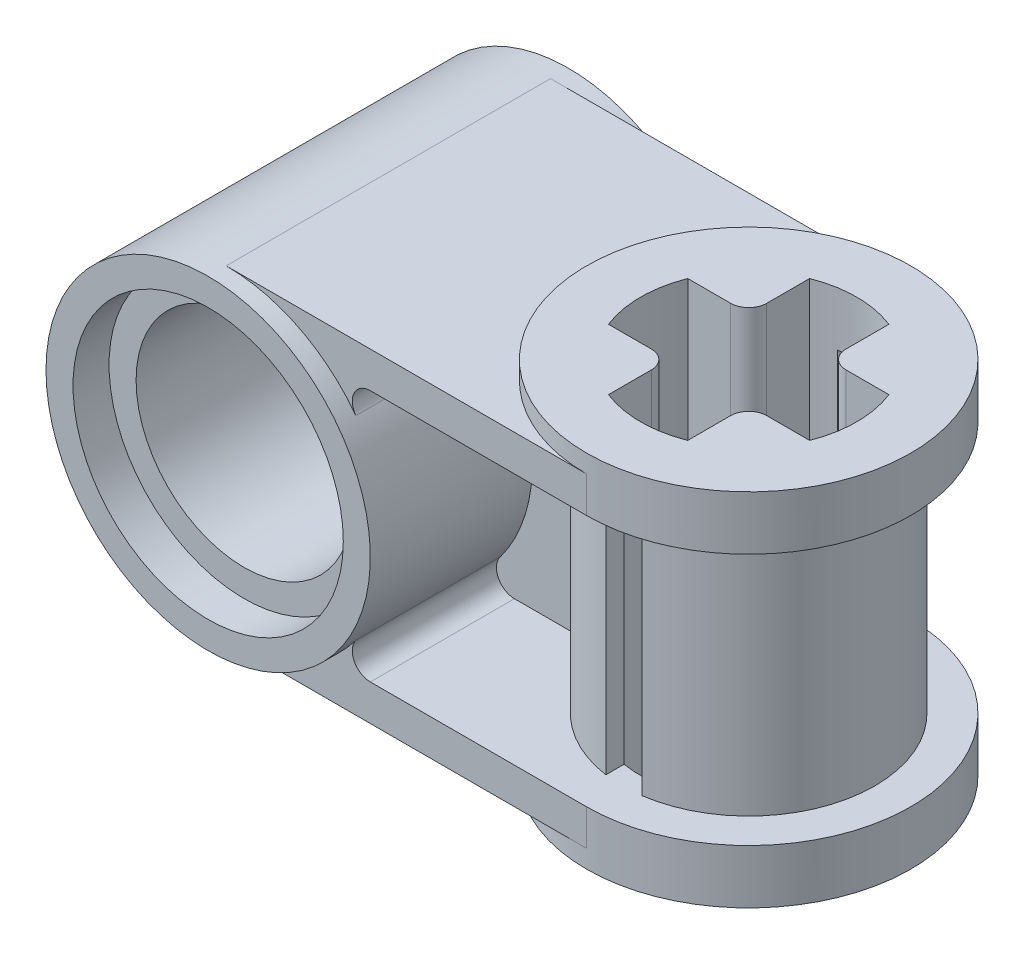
from build123d import *

# Parameters (mm, degrees)
BOSS_EXTRUDE1_DEPTH      = 3.6
BOSS_EXTRUDE1_DEPTH_BACK = 3.6
BOSS_EXTRUDE2_DEPTH      = 0.4
BOSS_EXTRUDE2_DEPTH_BACK = 7.6
CUT_EXTRUDE1_DEPTH       = 15.327595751
CUT_EXTRUDE1_DEPTH_BACK  = 15.327595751
SKETCH3_R                = 2.4
SKETCH4_R                = 3
CUT_EXTRUDE2_DEPTH       = 0.4
SKETCH5_R                = 3.6
BOSS_EXTRUDE3_DEPTH      = 0.4
CUT_EXTRUDE3_DEPTH       = 15.647866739
CUT_EXTRUDE4_DEPTH       = 3.2
CUT_EXTRUDE6_DEPTH       = 2.8
CUT_EXTRUDE6_DEPTH_BACK  = 2.8
SKETCH9_W                = 0.8
SKETCH9_H                = 5.6
CUT_EXTRUDE7_DEPTH       = 15.433294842


with BuildPart() as part:
    # Sketch1 → Boss-Extrude1 (new, two sides: drawn at the far end of the back side and taken through both)
    with BuildSketch(Plane(origin=(0, 0, 0), x_dir=(1, 0, 0), z_dir=(0, 1, 0)).offset(-BOSS_EXTRUDE1_DEPTH_BACK)):
        with BuildLine():
            Line((0, 3.6), (-8, 3.6))
            Line((-8, 3.6), (-8, -3.6))
            Line((-8, -3.6), (0, -3.6))
            ThreePointArc((0, -3.6), (3.6, 0), (0, 3.6))
        make_face()
    extrude(amount=BOSS_EXTRUDE1_DEPTH + BOSS_EXTRUDE1_DEPTH_BACK)

    # Sketch2 → Boss-Extrude2 (add, two sides: drawn at the far end of the back side and taken through both)
    with BuildSketch(Plane.XY.offset(3.6).offset(-BOSS_EXTRUDE2_DEPTH_BACK)):
        with BuildLine():
            ThreePointArc((-8, 3.6), (-11.6, 0), (-8, -3.6))
            ThreePointArc((-8, -3.6), (-4.4, 0), (-8, 3.6))
        make_face()
    extrude(amount=BOSS_EXTRUDE2_DEPTH + BOSS_EXTRUDE2_DEPTH_BACK)

    # Sketch3 → Cut-Extrude1 (cut, two sides: drawn at the far end of the back side and taken through both)
    with BuildSketch(Plane.XY.offset(3.6).offset(-CUT_EXTRUDE1_DEPTH_BACK)):
        with Locations((-8, 0)):
            Circle(SKETCH3_R)
    extrude(amount=CUT_EXTRUDE1_DEPTH + CUT_EXTRUDE1_DEPTH_BACK, mode=Mode.SUBTRACT)

    # Sketch4 → Cut-Extrude2 (cut, symmetric)
    with BuildSketch(Plane.XY.offset(3.6)):
        with Locations((-8, 0)):
            Circle(SKETCH4_R)
    cut_extrude2 = extrude(amount=CUT_EXTRUDE2_DEPTH, both=True, mode=Mode.SUBTRACT)

    # Mirror1: Cut-Extrude2 across plane
    add(cut_extrude2.mirror(Plane.XY), mode=Mode.SUBTRACT)

    # Sketch5 → Boss-Extrude3 (add)
    with BuildSketch(Plane(origin=(0, 3.6, 0), x_dir=(1, 0, 0), z_dir=(0, 1, 0))):
        with Locations(Location((0, 0, 0), (0, 0, 270))):
            Circle(SKETCH5_R)
    boss_extrude3 = extrude(amount=BOSS_EXTRUDE3_DEPTH)

    # Mirror2: Boss-Extrude3 across plane
    add(boss_extrude3.mirror(Plane.ZX))

    # Sketch6 → Cut-Extrude3 (cut, through all)
    with BuildSketch(Plane(origin=(0, 4, 0), x_dir=(1, 0, 0), z_dir=(0, 1, 0))):
        with BuildLine():
            Line((-0.88, 2.232845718), (-0.88, 1.28))
            ThreePointArc((-0.88, 1.28), (-0.997157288, 0.997157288), (-1.28, 0.88))
            Line((-1.28, 0.88), (-2.232845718, 0.88))
            ThreePointArc((-2.232845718, 0.88), (-2.4, 0), (-2.232845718, -0.88))
            Line((-2.232845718, -0.88), (-1.28, -0.88))
            ThreePointArc((-1.28, -0.88), (-0.997157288, -0.997157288), (-0.88, -1.28))
            Line((-0.88, -1.28), (-0.88, -2.232845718))
            ThreePointArc((-0.88, -2.232845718), (0, -2.4), (0.88, -2.232845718))
            Line((0.88, -2.232845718), (0.88, -1.28))
            ThreePointArc((0.88, -1.28), (0.997157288, -0.997157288), (1.28, -0.88))
            Line((1.28, -0.88), (2.232845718, -0.88))
            ThreePointArc((2.232845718, -0.88), (2.4, 0), (2.232845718, 0.88))
            Line((2.232845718, 0.88), (1.28, 0.88))
            ThreePointArc((1.28, 0.88), (0.997157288, 0.997157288), (0.88, 1.28))
            Line((0.88, 1.28), (0.88, 2.232845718))
            ThreePointArc((0.88, 2.232845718), (0, 2.4), (-0.88, 2.232845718))
        make_face()
    extrude(amount=-CUT_EXTRUDE3_DEPTH, mode=Mode.SUBTRACT)

    # Sketch7 → Cut-Extrude4 (cut)
    with BuildSketch(Plane.XY.offset(3.6)):
        with BuildLine():
            Line((-4, 2.8), (-4, -2.8))
            Line((-4, -2.8), (-4.8, -2.8))
            ThreePointArc((-4.8, -2.8), (-5.157770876, -2.578885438), (-5.12, -2.16))
            ThreePointArc((-5.12, -2.16), (-4.4, 0), (-5.12, 2.16))
            ThreePointArc((-5.12, 2.16), (-5.157770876, 2.578885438), (-4.8, 2.8))
            Line((-4.8, 2.8), (-4, 2.8))
        make_face()
    cut_extrude4 = extrude(amount=-CUT_EXTRUDE4_DEPTH, mode=Mode.SUBTRACT)

    # Mirror3: Cut-Extrude4 across plane
    add(cut_extrude4.mirror(Plane.XY), mode=Mode.SUBTRACT)

    # Sketch8 → Cut-Extrude6 (cut, two sides: drawn at the far end of the back side and taken through both)
    with BuildSketch(Plane(origin=(0, 0, 0), x_dir=(1, 0, 0), z_dir=(0, 1, 0)).offset(-CUT_EXTRUDE6_DEPTH_BACK)):
        with BuildLine():
            Line((-2.771281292, 0.4), (-4.117178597, 0.4))
            Line((-4.117178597, 0.4), (-4.117178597, 5.37406554))
            Line((-4.117178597, 5.37406554), (4.164604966, 5.37406554))
            Line((4.164604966, 5.37406554), (4.164604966, -5.523115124))
            Line((4.164604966, -5.523115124), (-4.117178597, -5.523115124))
            Line((-4.117178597, -5.523115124), (-4.117178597, -0.4))
            Line((-4.117178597, -0.4), (-2.771281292, -0.4))
            ThreePointArc((-2.771281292, -0.4), (2.8, 0), (-2.771281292, 0.4))
        make_face()
    extrude(amount=CUT_EXTRUDE6_DEPTH + CUT_EXTRUDE6_DEPTH_BACK, mode=Mode.SUBTRACT)

    # Sketch9 → Cut-Extrude7 (cut, through all)
    with BuildSketch(Plane.XY.offset(3.6)):
        Rectangle(SKETCH9_W, SKETCH9_H)
    extrude(amount=-CUT_EXTRUDE7_DEPTH, mode=Mode.SUBTRACT)


solid = part.part
